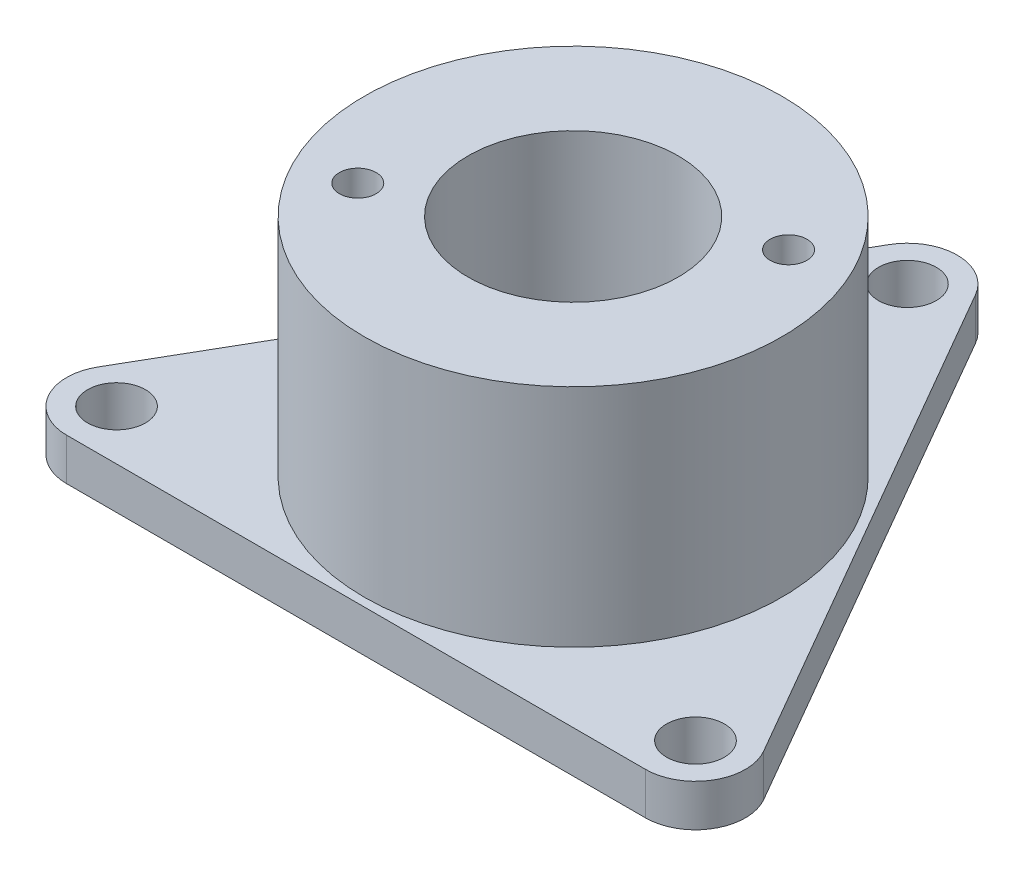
from build123d import *

# Parameters (mm, degrees)
SKETCH1_R           = 15.75
SKETCH1_R_2         = 2.75
BOSS_EXTRUDE1_DEPTH = 3.999992
SKETCH2_R           = 19.8475
SKETCH2_R_2         = 10
BOSS_EXTRUDE2_DEPTH = 21.460000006
SKETCH3_R           = 1.75
CUT_EXTRUDE1_DEPTH  = 20.574
CHAMFER1_SIZE       = 5.588
CHAMFER1_SIZE2      = 1.708423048


with BuildPart() as part:
    # Sketch1 → Boss-Extrude1 (new body)
    with BuildSketch(Plane(origin=(0, 0, 0), x_dir=(1, 0, 0), z_dir=(0, 1, 0))):
        with BuildLine():
            Line((-4.113620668, 34.1758), (-31.653921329, -13.5254))
            ThreePointArc((-31.653921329, -13.5254), (-31.653921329, -18.2754), (-27.540300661, -20.6504))
            Line((-27.540300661, -20.6504), (27.540300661, -20.6504))
            ThreePointArc((27.540300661, -20.6504), (31.653921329, -18.2754), (31.653921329, -13.5254))
            Line((31.653921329, -13.5254), (4.113620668, 34.1758))
            ThreePointArc((4.113620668, 34.1758), (0, 36.5508), (-4.113620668, 34.1758))
        make_face()
        with Locations(Location((0, 0, 0), (0, 0, 270))):
            Circle(SKETCH1_R, mode=Mode.SUBTRACT)
        with Locations(Location((0, 31.8008, 0), (0, 0, 270))):
            Circle(SKETCH1_R_2, mode=Mode.SUBTRACT)
        with Locations(Location((27.540300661, -15.9004, 0), (0, 0, 270))):
            Circle(SKETCH1_R_2, mode=Mode.SUBTRACT)
        with Locations(Location((-27.540300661, -15.9004, 0), (0, 0, 270))):
            Circle(SKETCH1_R_2, mode=Mode.SUBTRACT)
    extrude(amount=BOSS_EXTRUDE1_DEPTH)

    # Sketch2 → Boss-Extrude2 (add)
    with BuildSketch(Plane(origin=(0, 3.999992, 0), x_dir=(1, 0, 0), z_dir=(0, 1, 0))):
        with Locations(Location((0, 0, 0), (0, 0, 90))):
            Circle(SKETCH2_R)
        with Locations(Location((0, 0, 0), (0, 0, 90))):
            Circle(SKETCH2_R_2, mode=Mode.SUBTRACT)
    extrude(amount=BOSS_EXTRUDE2_DEPTH)

    # Sketch3 → Cut-Extrude1 (cut)
    with BuildSketch(Plane(origin=(0, 25.459992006, 0), x_dir=(1, 0, 0), z_dir=(0, 1, 0))):
        with Locations(Location((-12.990381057, -7.5, 0), (0, 0, 270))):
            Circle(SKETCH3_R)
        with Locations(Location((12.990381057, 7.5, 0), (0, 0, 270))):
            Circle(SKETCH3_R)
    extrude(amount=-CUT_EXTRUDE1_DEPTH, mode=Mode.SUBTRACT)

    # Chamfer1
    chamfer1_edges = [part.edges().sort_by_distance(p)[0] for p in [
        (0, 3.999992, -15.75),
    ]]
    chamfer1_side = [part.faces().sort_by_distance(p)[0] for p in [
        (0, 3.999992, -15.304522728),
    ]]
    chamfer(chamfer1_edges, length=CHAMFER1_SIZE, length2=CHAMFER1_SIZE2, reference=chamfer1_side[0])


solid = part.part
